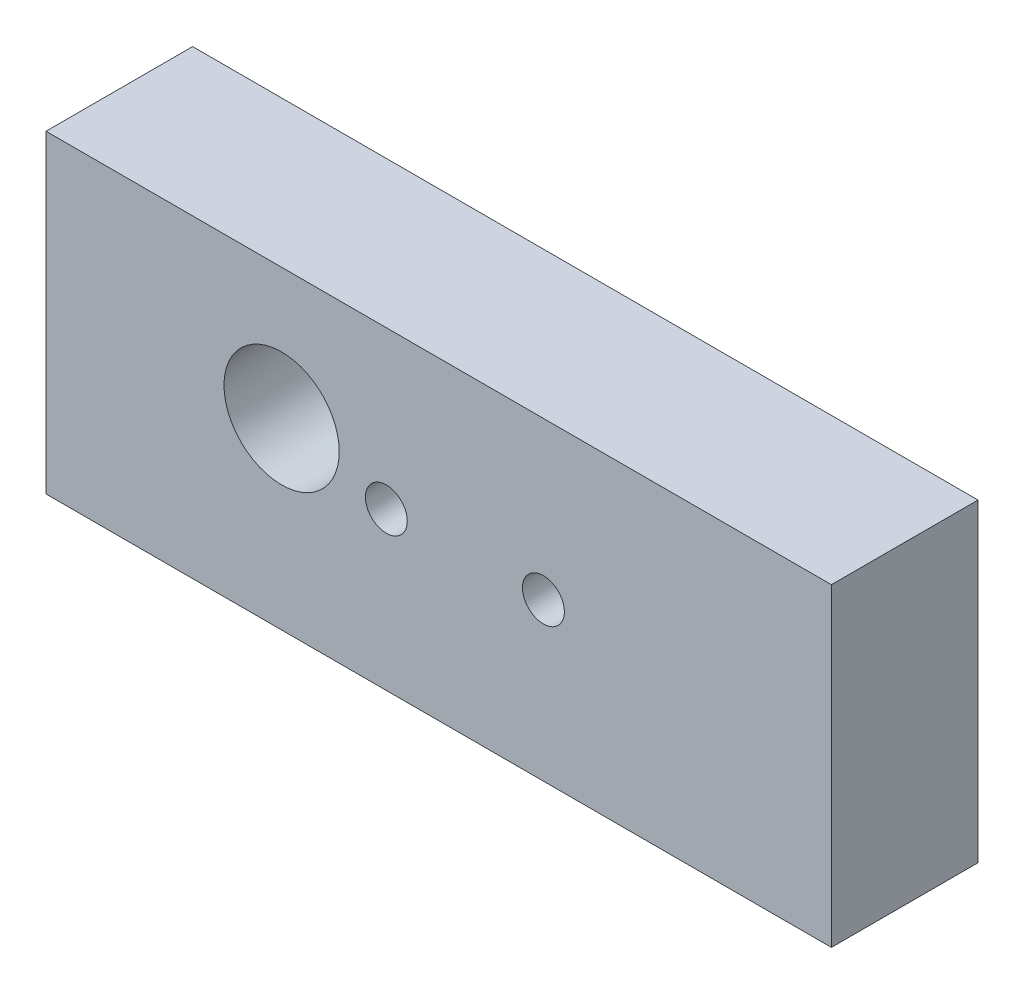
ISO-10303-21;
HEADER;
FILE_DESCRIPTION(('STEP AP214'),'2;1');
FILE_NAME('part.step','',(''),(''),'','','');
FILE_SCHEMA(('AUTOMOTIVE_DESIGN { 1 0 10303 214 1 1 1 1 }'));
ENDSEC;
DATA;
#1=APPLICATION_CONTEXT('core data for automotive mechanical design processes');
#2=APPLICATION_PROTOCOL_DEFINITION('international standard','automotive_design',2000,#1);
#3=PRODUCT_CONTEXT('',#1,'mechanical');
#4=PRODUCT('Part','Part','',(#3));
#5=PRODUCT_RELATED_PRODUCT_CATEGORY('part','',(#4));
#6=PRODUCT_DEFINITION_FORMATION('','',#4);
#7=PRODUCT_DEFINITION_CONTEXT('part definition',#1,'design');
#8=PRODUCT_DEFINITION('design','',#6,#7);
#9=PRODUCT_DEFINITION_SHAPE('','',#8);
#10=(LENGTH_UNIT() NAMED_UNIT(*) SI_UNIT(.MILLI.,.METRE.));
#11=(NAMED_UNIT(*) PLANE_ANGLE_UNIT() SI_UNIT($,.RADIAN.));
#12=(NAMED_UNIT(*) SI_UNIT($,.STERADIAN.) SOLID_ANGLE_UNIT());
#13=UNCERTAINTY_MEASURE_WITH_UNIT(LENGTH_MEASURE(1.E-05),#10,'distance_accuracy_value','');
#14=(GEOMETRIC_REPRESENTATION_CONTEXT(3) GLOBAL_UNCERTAINTY_ASSIGNED_CONTEXT((#13)) GLOBAL_UNIT_ASSIGNED_CONTEXT((#10,
#11,#12)) REPRESENTATION_CONTEXT('',''));
#15=CARTESIAN_POINT('',(0.,0.,0.));
#16=DIRECTION('',(0.,0.,1.));
#17=DIRECTION('',(1.,0.,0.));
#18=AXIS2_PLACEMENT_3D('',#15,#16,#17);
#19=CARTESIAN_POINT('',(0.,0.,-28.));
#20=DIRECTION('',(-1.,0.,0.));
#21=DIRECTION('',(0.,0.,1.));
#22=AXIS2_PLACEMENT_3D('',#19,#20,#21);
#23=PLANE('',#22);
#24=DIRECTION('',(0.,-1.,0.));
#25=VECTOR('',#24,1.);
#26=CARTESIAN_POINT('',(0.,0.,0.));
#27=LINE('',#26,#25);
#28=CARTESIAN_POINT('',(0.,60.,0.));
#29=VERTEX_POINT('',#28);
#30=CARTESIAN_POINT('',(0.,0.,0.));
#31=VERTEX_POINT('',#30);
#32=EDGE_CURVE('E102',#29,#31,#27,.T.);
#33=ORIENTED_EDGE('',*,*,#32,.F.);
#34=DIRECTION('',(0.,0.,1.));
#35=VECTOR('',#34,1.);
#36=CARTESIAN_POINT('',(0.,60.,-28.));
#37=LINE('',#36,#35);
#38=CARTESIAN_POINT('',(0.,60.,-28.));
#39=VERTEX_POINT('',#38);
#40=EDGE_CURVE('E11',#39,#29,#37,.T.);
#41=ORIENTED_EDGE('',*,*,#40,.F.);
#42=DIRECTION('',(0.,-1.,0.));
#43=VECTOR('',#42,1.);
#44=CARTESIAN_POINT('',(0.,0.,-28.));
#45=LINE('',#44,#43);
#46=CARTESIAN_POINT('',(0.,0.,-28.));
#47=VERTEX_POINT('',#46);
#48=EDGE_CURVE('E100',#39,#47,#45,.T.);
#49=ORIENTED_EDGE('',*,*,#48,.T.);
#50=DIRECTION('',(0.,0.,1.));
#51=VECTOR('',#50,1.);
#52=CARTESIAN_POINT('',(0.,0.,-28.));
#53=LINE('',#52,#51);
#54=EDGE_CURVE('E45',#47,#31,#53,.T.);
#55=ORIENTED_EDGE('',*,*,#54,.T.);
#56=EDGE_LOOP('',(#33,#41,#49,#55));
#57=FACE_BOUND('',#56,.T.);
#58=ADVANCED_FACE('F39',(#57),#23,.T.);
#59=CARTESIAN_POINT('',(0.,60.,-28.));
#60=DIRECTION('',(0.,1.,0.));
#61=DIRECTION('',(0.,0.,1.));
#62=AXIS2_PLACEMENT_3D('',#59,#60,#61);
#63=PLANE('',#62);
#64=DIRECTION('',(-1.,0.,0.));
#65=VECTOR('',#64,1.);
#66=CARTESIAN_POINT('',(0.,60.,0.));
#67=LINE('',#66,#65);
#68=CARTESIAN_POINT('',(150.,60.,0.));
#69=VERTEX_POINT('',#68);
#70=EDGE_CURVE('E97',#69,#29,#67,.T.);
#71=ORIENTED_EDGE('',*,*,#70,.F.);
#72=DIRECTION('',(0.,0.,1.));
#73=VECTOR('',#72,1.);
#74=CARTESIAN_POINT('',(150.,60.,-28.));
#75=LINE('',#74,#73);
#76=CARTESIAN_POINT('',(150.,60.,-28.));
#77=VERTEX_POINT('',#76);
#78=EDGE_CURVE('E48',#77,#69,#75,.T.);
#79=ORIENTED_EDGE('',*,*,#78,.F.);
#80=DIRECTION('',(-1.,0.,0.));
#81=VECTOR('',#80,1.);
#82=CARTESIAN_POINT('',(0.,60.,-28.));
#83=LINE('',#82,#81);
#84=EDGE_CURVE('E94',#77,#39,#83,.T.);
#85=ORIENTED_EDGE('',*,*,#84,.T.);
#86=ORIENTED_EDGE('',*,*,#40,.T.);
#87=EDGE_LOOP('',(#71,#79,#85,#86));
#88=FACE_BOUND('',#87,.T.);
#89=ADVANCED_FACE('F113',(#88),#63,.T.);
#90=CARTESIAN_POINT('',(150.,0.,-28.));
#91=DIRECTION('',(1.,0.,0.));
#92=DIRECTION('',(0.,0.,-1.));
#93=AXIS2_PLACEMENT_3D('',#90,#91,#92);
#94=PLANE('',#93);
#95=DIRECTION('',(0.,1.,0.));
#96=VECTOR('',#95,1.);
#97=CARTESIAN_POINT('',(150.,0.,0.));
#98=LINE('',#97,#96);
#99=CARTESIAN_POINT('',(150.,0.,0.));
#100=VERTEX_POINT('',#99);
#101=EDGE_CURVE('E90',#100,#69,#98,.T.);
#102=ORIENTED_EDGE('',*,*,#101,.F.);
#103=DIRECTION('',(0.,0.,1.));
#104=VECTOR('',#103,1.);
#105=CARTESIAN_POINT('',(150.,0.,-28.));
#106=LINE('',#105,#104);
#107=CARTESIAN_POINT('',(150.,0.,-28.));
#108=VERTEX_POINT('',#107);
#109=EDGE_CURVE('E84',#108,#100,#106,.T.);
#110=ORIENTED_EDGE('',*,*,#109,.F.);
#111=DIRECTION('',(0.,1.,0.));
#112=VECTOR('',#111,1.);
#113=CARTESIAN_POINT('',(150.,0.,-28.));
#114=LINE('',#113,#112);
#115=EDGE_CURVE('E87',#108,#77,#114,.T.);
#116=ORIENTED_EDGE('',*,*,#115,.T.);
#117=ORIENTED_EDGE('',*,*,#78,.T.);
#118=EDGE_LOOP('',(#102,#110,#116,#117));
#119=FACE_BOUND('',#118,.T.);
#120=ADVANCED_FACE('F88',(#119),#94,.T.);
#121=CARTESIAN_POINT('',(0.,0.,-28.));
#122=DIRECTION('',(0.,-1.,0.));
#123=DIRECTION('',(0.,0.,-1.));
#124=AXIS2_PLACEMENT_3D('',#121,#122,#123);
#125=PLANE('',#124);
#126=DIRECTION('',(1.,0.,0.));
#127=VECTOR('',#126,1.);
#128=CARTESIAN_POINT('',(0.,0.,0.));
#129=LINE('',#128,#127);
#130=EDGE_CURVE('E110',#31,#100,#129,.T.);
#131=ORIENTED_EDGE('',*,*,#130,.F.);
#132=ORIENTED_EDGE('',*,*,#54,.F.);
#133=DIRECTION('',(1.,0.,0.));
#134=VECTOR('',#133,1.);
#135=CARTESIAN_POINT('',(0.,0.,-28.));
#136=LINE('',#135,#134);
#137=EDGE_CURVE('E91',#47,#108,#136,.T.);
#138=ORIENTED_EDGE('',*,*,#137,.T.);
#139=ORIENTED_EDGE('',*,*,#109,.T.);
#140=EDGE_LOOP('',(#131,#132,#138,#139));
#141=FACE_BOUND('',#140,.T.);
#142=ADVANCED_FACE('F96',(#141),#125,.T.);
#143=CARTESIAN_POINT('',(0.,0.,-28.));
#144=DIRECTION('',(0.,0.,-1.));
#145=DIRECTION('',(-1.,0.,0.));
#146=AXIS2_PLACEMENT_3D('',#143,#144,#145);
#147=PLANE('',#146);
#148=ORIENTED_EDGE('',*,*,#48,.F.);
#149=ORIENTED_EDGE('',*,*,#84,.F.);
#150=ORIENTED_EDGE('',*,*,#115,.F.);
#151=ORIENTED_EDGE('',*,*,#137,.F.);
#152=EDGE_LOOP('',(#148,#149,#150,#151));
#153=FACE_BOUND('',#152,.T.);
#154=ADVANCED_FACE('F95',(#153),#147,.T.);
#155=CARTESIAN_POINT('',(0.,0.,0.));
#156=DIRECTION('',(0.,0.,-1.));
#157=DIRECTION('',(-1.,0.,0.));
#158=AXIS2_PLACEMENT_3D('',#155,#156,#157);
#159=PLANE('',#158);
#160=CARTESIAN_POINT('',(65.,30.,0.));
#161=DIRECTION('',(0.,0.,1.));
#162=DIRECTION('',(1.,0.,0.));
#163=AXIS2_PLACEMENT_3D('',#160,#161,#162);
#164=CIRCLE('',#163,4.00000000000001);
#165=CARTESIAN_POINT('',(69.,30.,0.));
#166=VERTEX_POINT('',#165);
#167=EDGE_CURVE('E162',#166,#166,#164,.T.);
#168=ORIENTED_EDGE('',*,*,#167,.F.);
#169=EDGE_LOOP('',(#168));
#170=FACE_BOUND('',#169,.T.);
#171=CARTESIAN_POINT('',(95.,30.,0.));
#172=DIRECTION('',(0.,0.,1.));
#173=DIRECTION('',(1.,0.,0.));
#174=AXIS2_PLACEMENT_3D('',#171,#172,#173);
#175=CIRCLE('',#174,4.00000000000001);
#176=CARTESIAN_POINT('',(99.,30.,0.));
#177=VERTEX_POINT('',#176);
#178=EDGE_CURVE('E170',#177,#177,#175,.T.);
#179=ORIENTED_EDGE('',*,*,#178,.F.);
#180=EDGE_LOOP('',(#179));
#181=FACE_BOUND('',#180,.T.);
#182=CARTESIAN_POINT('',(45.,35.,0.));
#183=DIRECTION('',(0.,0.,1.));
#184=DIRECTION('',(1.,0.,0.));
#185=AXIS2_PLACEMENT_3D('',#182,#183,#184);
#186=CIRCLE('',#185,11.);
#187=CARTESIAN_POINT('',(56.,35.,0.));
#188=VERTEX_POINT('',#187);
#189=EDGE_CURVE('E165',#188,#188,#186,.T.);
#190=ORIENTED_EDGE('',*,*,#189,.F.);
#191=EDGE_LOOP('',(#190));
#192=FACE_BOUND('',#191,.T.);
#193=ORIENTED_EDGE('',*,*,#32,.T.);
#194=ORIENTED_EDGE('',*,*,#130,.T.);
#195=ORIENTED_EDGE('',*,*,#101,.T.);
#196=ORIENTED_EDGE('',*,*,#70,.T.);
#197=EDGE_LOOP('',(#193,#194,#195,#196));
#198=FACE_BOUND('',#197,.T.);
#199=ADVANCED_FACE('F111',(#170,#181,#192,#198),#159,.F.);
#200=CARTESIAN_POINT('',(45.,35.,-20.));
#201=DIRECTION('',(0.,0.,1.));
#202=DIRECTION('',(1.,0.,0.));
#203=AXIS2_PLACEMENT_3D('',#200,#201,#202);
#204=CYLINDRICAL_SURFACE('',#203,11.);
#205=CARTESIAN_POINT('',(45.,35.,-20.));
#206=DIRECTION('',(0.,0.,1.));
#207=DIRECTION('',(1.,0.,0.));
#208=AXIS2_PLACEMENT_3D('',#205,#206,#207);
#209=CIRCLE('',#208,11.);
#210=CARTESIAN_POINT('',(56.,35.,-20.));
#211=VERTEX_POINT('',#210);
#212=EDGE_CURVE('E107',#211,#211,#209,.T.);
#213=ORIENTED_EDGE('',*,*,#212,.F.);
#214=EDGE_LOOP('',(#213));
#215=FACE_BOUND('',#214,.T.);
#216=ORIENTED_EDGE('',*,*,#189,.T.);
#217=EDGE_LOOP('',(#216));
#218=FACE_BOUND('',#217,.T.);
#219=ADVANCED_FACE('F133',(#215,#218),#204,.F.);
#220=CARTESIAN_POINT('',(45.,35.,-20.));
#221=DIRECTION('',(0.,0.,1.));
#222=DIRECTION('',(1.,0.,0.));
#223=AXIS2_PLACEMENT_3D('',#220,#221,#222);
#224=PLANE('',#223);
#225=ORIENTED_EDGE('',*,*,#212,.T.);
#226=EDGE_LOOP('',(#225));
#227=FACE_BOUND('',#226,.T.);
#228=ADVANCED_FACE('F140',(#227),#224,.T.);
#229=CARTESIAN_POINT('',(95.,30.,-20.));
#230=DIRECTION('',(0.,0.,1.));
#231=DIRECTION('',(1.,0.,0.));
#232=AXIS2_PLACEMENT_3D('',#229,#230,#231);
#233=CYLINDRICAL_SURFACE('',#232,4.00000000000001);
#234=CARTESIAN_POINT('',(95.,30.,-20.));
#235=DIRECTION('',(0.,0.,1.));
#236=DIRECTION('',(1.,0.,0.));
#237=AXIS2_PLACEMENT_3D('',#234,#235,#236);
#238=CIRCLE('',#237,4.00000000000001);
#239=CARTESIAN_POINT('',(99.,30.,-20.));
#240=VERTEX_POINT('',#239);
#241=EDGE_CURVE('E175',#240,#240,#238,.T.);
#242=ORIENTED_EDGE('',*,*,#241,.F.);
#243=EDGE_LOOP('',(#242));
#244=FACE_BOUND('',#243,.T.);
#245=ORIENTED_EDGE('',*,*,#178,.T.);
#246=EDGE_LOOP('',(#245));
#247=FACE_BOUND('',#246,.T.);
#248=ADVANCED_FACE('F143',(#244,#247),#233,.F.);
#249=CARTESIAN_POINT('',(95.,30.,-20.));
#250=DIRECTION('',(0.,0.,1.));
#251=DIRECTION('',(1.,0.,0.));
#252=AXIS2_PLACEMENT_3D('',#249,#250,#251);
#253=PLANE('',#252);
#254=ORIENTED_EDGE('',*,*,#241,.T.);
#255=EDGE_LOOP('',(#254));
#256=FACE_BOUND('',#255,.T.);
#257=ADVANCED_FACE('F141',(#256),#253,.T.);
#258=CARTESIAN_POINT('',(65.,30.,-20.));
#259=DIRECTION('',(0.,0.,1.));
#260=DIRECTION('',(1.,0.,0.));
#261=AXIS2_PLACEMENT_3D('',#258,#259,#260);
#262=CYLINDRICAL_SURFACE('',#261,4.00000000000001);
#263=CARTESIAN_POINT('',(65.,30.,-20.));
#264=DIRECTION('',(0.,0.,1.));
#265=DIRECTION('',(1.,0.,0.));
#266=AXIS2_PLACEMENT_3D('',#263,#264,#265);
#267=CIRCLE('',#266,4.00000000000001);
#268=CARTESIAN_POINT('',(69.,30.,-20.));
#269=VERTEX_POINT('',#268);
#270=EDGE_CURVE('E161',#269,#269,#267,.T.);
#271=ORIENTED_EDGE('',*,*,#270,.F.);
#272=EDGE_LOOP('',(#271));
#273=FACE_BOUND('',#272,.T.);
#274=ORIENTED_EDGE('',*,*,#167,.T.);
#275=EDGE_LOOP('',(#274));
#276=FACE_BOUND('',#275,.T.);
#277=ADVANCED_FACE('F148',(#273,#276),#262,.F.);
#278=CARTESIAN_POINT('',(65.,30.,-20.));
#279=DIRECTION('',(0.,0.,1.));
#280=DIRECTION('',(1.,0.,0.));
#281=AXIS2_PLACEMENT_3D('',#278,#279,#280);
#282=PLANE('',#281);
#283=ORIENTED_EDGE('',*,*,#270,.T.);
#284=EDGE_LOOP('',(#283));
#285=FACE_BOUND('',#284,.T.);
#286=ADVANCED_FACE('F153',(#285),#282,.T.);
#287=CLOSED_SHELL('',(#58,#89,#120,#142,#154,#199,#219,#228,#248,#257,#277,#286));
#288=MANIFOLD_SOLID_BREP('B2',#287);
#289=ADVANCED_BREP_SHAPE_REPRESENTATION('',(#18,#288),#14);
#290=SHAPE_DEFINITION_REPRESENTATION(#9,#289);
ENDSEC;
END-ISO-10303-21;
